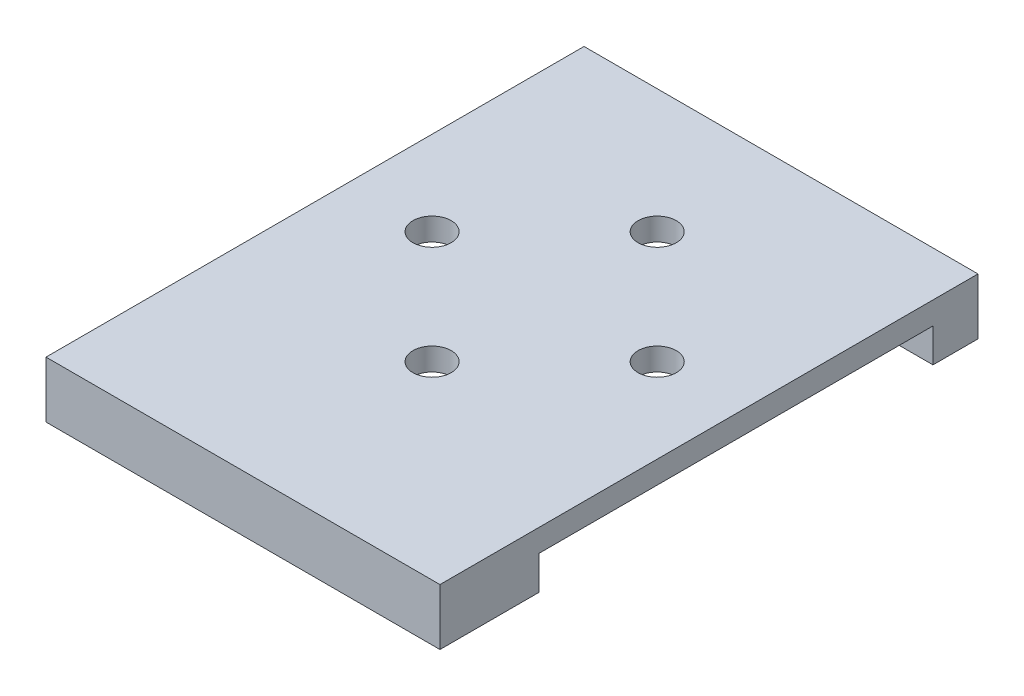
ISO-10303-21;
HEADER;
FILE_DESCRIPTION(('STEP AP214'),'2;1');
FILE_NAME('part.step','',(''),(''),'','','');
FILE_SCHEMA(('AUTOMOTIVE_DESIGN { 1 0 10303 214 1 1 1 1 }'));
ENDSEC;
DATA;
#1=APPLICATION_CONTEXT('core data for automotive mechanical design processes');
#2=APPLICATION_PROTOCOL_DEFINITION('international standard','automotive_design',2000,#1);
#3=PRODUCT_CONTEXT('',#1,'mechanical');
#4=PRODUCT('Part','Part','',(#3));
#5=PRODUCT_RELATED_PRODUCT_CATEGORY('part','',(#4));
#6=PRODUCT_DEFINITION_FORMATION('','',#4);
#7=PRODUCT_DEFINITION_CONTEXT('part definition',#1,'design');
#8=PRODUCT_DEFINITION('design','',#6,#7);
#9=PRODUCT_DEFINITION_SHAPE('','',#8);
#10=(LENGTH_UNIT() NAMED_UNIT(*) SI_UNIT(.MILLI.,.METRE.));
#11=(NAMED_UNIT(*) PLANE_ANGLE_UNIT() SI_UNIT($,.RADIAN.));
#12=(NAMED_UNIT(*) SI_UNIT($,.STERADIAN.) SOLID_ANGLE_UNIT());
#13=UNCERTAINTY_MEASURE_WITH_UNIT(LENGTH_MEASURE(1.E-05),#10,'distance_accuracy_value','');
#14=(GEOMETRIC_REPRESENTATION_CONTEXT(3) GLOBAL_UNCERTAINTY_ASSIGNED_CONTEXT((#13)) GLOBAL_UNIT_ASSIGNED_CONTEXT((#10,
#11,#12)) REPRESENTATION_CONTEXT('',''));
#15=CARTESIAN_POINT('',(0.,0.,0.));
#16=DIRECTION('',(0.,0.,1.));
#17=DIRECTION('',(1.,0.,0.));
#18=AXIS2_PLACEMENT_3D('',#15,#16,#17);
#19=CARTESIAN_POINT('',(0.,0.,0.));
#20=DIRECTION('',(0.,1.,0.));
#21=DIRECTION('',(0.,0.,1.));
#22=AXIS2_PLACEMENT_3D('',#19,#20,#21);
#23=PLANE('',#22);
#24=DIRECTION('',(0.,0.,-1.));
#25=VECTOR('',#24,1.);
#26=CARTESIAN_POINT('',(17.5,0.,23.9));
#27=LINE('',#26,#25);
#28=CARTESIAN_POINT('',(17.5,0.,-19.9));
#29=VERTEX_POINT('',#28);
#30=CARTESIAN_POINT('',(17.5,0.,-23.9));
#31=VERTEX_POINT('',#30);
#32=EDGE_CURVE('E125',#29,#31,#27,.T.);
#33=ORIENTED_EDGE('',*,*,#32,.F.);
#34=DIRECTION('',(-1.,0.,0.));
#35=VECTOR('',#34,1.);
#36=CARTESIAN_POINT('',(17.5,0.,-19.9));
#37=LINE('',#36,#35);
#38=CARTESIAN_POINT('',(-17.5,0.,-19.9));
#39=VERTEX_POINT('',#38);
#40=EDGE_CURVE('E108',#29,#39,#37,.T.);
#41=ORIENTED_EDGE('',*,*,#40,.T.);
#42=DIRECTION('',(0.,0.,1.));
#43=VECTOR('',#42,1.);
#44=CARTESIAN_POINT('',(-17.5,0.,23.9));
#45=LINE('',#44,#43);
#46=CARTESIAN_POINT('',(-17.5,0.,-23.9));
#47=VERTEX_POINT('',#46);
#48=EDGE_CURVE('E133',#47,#39,#45,.T.);
#49=ORIENTED_EDGE('',*,*,#48,.F.);
#50=DIRECTION('',(-1.,0.,0.));
#51=VECTOR('',#50,1.);
#52=CARTESIAN_POINT('',(17.5,0.,-23.9));
#53=LINE('',#52,#51);
#54=EDGE_CURVE('E79',#31,#47,#53,.T.);
#55=ORIENTED_EDGE('',*,*,#54,.F.);
#56=EDGE_LOOP('',(#33,#41,#49,#55));
#57=FACE_BOUND('',#56,.T.);
#58=ADVANCED_FACE('F33',(#57),#23,.F.);
#59=CARTESIAN_POINT('',(-17.5,5.,23.9));
#60=DIRECTION('',(1.,0.,0.));
#61=DIRECTION('',(0.,0.,-1.));
#62=AXIS2_PLACEMENT_3D('',#59,#60,#61);
#63=PLANE('',#62);
#64=ORIENTED_EDGE('',*,*,#48,.T.);
#65=DIRECTION('',(0.,-1.,0.));
#66=VECTOR('',#65,1.);
#67=CARTESIAN_POINT('',(-17.5,0.,-19.9));
#68=LINE('',#67,#66);
#69=CARTESIAN_POINT('',(-17.5,3.,-19.9));
#70=VERTEX_POINT('',#69);
#71=EDGE_CURVE('E114',#70,#39,#68,.T.);
#72=ORIENTED_EDGE('',*,*,#71,.F.);
#73=DIRECTION('',(0.,0.,-1.));
#74=VECTOR('',#73,1.);
#75=CARTESIAN_POINT('',(-17.5,3.,-19.9));
#76=LINE('',#75,#74);
#77=CARTESIAN_POINT('',(-17.5,3.,15.1));
#78=VERTEX_POINT('',#77);
#79=EDGE_CURVE('E127',#78,#70,#76,.T.);
#80=ORIENTED_EDGE('',*,*,#79,.F.);
#81=DIRECTION('',(0.,1.,0.));
#82=VECTOR('',#81,1.);
#83=CARTESIAN_POINT('',(-17.5,0.,15.1));
#84=LINE('',#83,#82);
#85=CARTESIAN_POINT('',(-17.5,0.,15.1));
#86=VERTEX_POINT('',#85);
#87=EDGE_CURVE('E188',#86,#78,#84,.T.);
#88=ORIENTED_EDGE('',*,*,#87,.F.);
#89=CARTESIAN_POINT('',(-17.5,0.,23.9));
#90=VERTEX_POINT('',#89);
#91=EDGE_CURVE('E151',#86,#90,#45,.T.);
#92=ORIENTED_EDGE('',*,*,#91,.T.);
#93=DIRECTION('',(0.,-1.,0.));
#94=VECTOR('',#93,1.);
#95=CARTESIAN_POINT('',(-17.5,5.,23.9));
#96=LINE('',#95,#94);
#97=CARTESIAN_POINT('',(-17.5,5.,23.9));
#98=VERTEX_POINT('',#97);
#99=EDGE_CURVE('E11',#98,#90,#96,.T.);
#100=ORIENTED_EDGE('',*,*,#99,.F.);
#101=DIRECTION('',(0.,0.,1.));
#102=VECTOR('',#101,1.);
#103=CARTESIAN_POINT('',(-17.5,5.,23.9));
#104=LINE('',#103,#102);
#105=CARTESIAN_POINT('',(-17.5,5.,-23.9));
#106=VERTEX_POINT('',#105);
#107=EDGE_CURVE('E138',#106,#98,#104,.T.);
#108=ORIENTED_EDGE('',*,*,#107,.F.);
#109=DIRECTION('',(0.,-1.,0.));
#110=VECTOR('',#109,1.);
#111=CARTESIAN_POINT('',(-17.5,5.,-23.9));
#112=LINE('',#111,#110);
#113=EDGE_CURVE('E139',#106,#47,#112,.T.);
#114=ORIENTED_EDGE('',*,*,#113,.T.);
#115=EDGE_LOOP('',(#64,#72,#80,#88,#92,#100,#108,#114));
#116=FACE_BOUND('',#115,.T.);
#117=ADVANCED_FACE('F35',(#116),#63,.F.);
#118=CARTESIAN_POINT('',(17.5,5.,23.9));
#119=DIRECTION('',(0.,0.,-1.));
#120=DIRECTION('',(-1.,0.,0.));
#121=AXIS2_PLACEMENT_3D('',#118,#119,#120);
#122=PLANE('',#121);
#123=DIRECTION('',(1.,0.,0.));
#124=VECTOR('',#123,1.);
#125=CARTESIAN_POINT('',(17.5,0.,23.9));
#126=LINE('',#125,#124);
#127=CARTESIAN_POINT('',(17.5,0.,23.9));
#128=VERTEX_POINT('',#127);
#129=EDGE_CURVE('E130',#90,#128,#126,.T.);
#130=ORIENTED_EDGE('',*,*,#129,.T.);
#131=DIRECTION('',(0.,-1.,0.));
#132=VECTOR('',#131,1.);
#133=CARTESIAN_POINT('',(17.5,5.,23.9));
#134=LINE('',#133,#132);
#135=CARTESIAN_POINT('',(17.5,5.,23.9));
#136=VERTEX_POINT('',#135);
#137=EDGE_CURVE('E42',#136,#128,#134,.T.);
#138=ORIENTED_EDGE('',*,*,#137,.F.);
#139=DIRECTION('',(1.,0.,0.));
#140=VECTOR('',#139,1.);
#141=CARTESIAN_POINT('',(17.5,5.,23.9));
#142=LINE('',#141,#140);
#143=EDGE_CURVE('E86',#98,#136,#142,.T.);
#144=ORIENTED_EDGE('',*,*,#143,.F.);
#145=ORIENTED_EDGE('',*,*,#99,.T.);
#146=EDGE_LOOP('',(#130,#138,#144,#145));
#147=FACE_BOUND('',#146,.T.);
#148=ADVANCED_FACE('F227',(#147),#122,.F.);
#149=CARTESIAN_POINT('',(17.5,5.,23.9));
#150=DIRECTION('',(-1.,0.,0.));
#151=DIRECTION('',(0.,0.,1.));
#152=AXIS2_PLACEMENT_3D('',#149,#150,#151);
#153=PLANE('',#152);
#154=DIRECTION('',(0.,0.,-1.));
#155=VECTOR('',#154,1.);
#156=CARTESIAN_POINT('',(17.5,3.,-19.9));
#157=LINE('',#156,#155);
#158=CARTESIAN_POINT('',(17.5,3.,15.1));
#159=VERTEX_POINT('',#158);
#160=CARTESIAN_POINT('',(17.5,3.,-19.9));
#161=VERTEX_POINT('',#160);
#162=EDGE_CURVE('E120',#159,#161,#157,.T.);
#163=ORIENTED_EDGE('',*,*,#162,.T.);
#164=DIRECTION('',(0.,-1.,0.));
#165=VECTOR('',#164,1.);
#166=CARTESIAN_POINT('',(17.5,0.,-19.9));
#167=LINE('',#166,#165);
#168=EDGE_CURVE('E111',#161,#29,#167,.T.);
#169=ORIENTED_EDGE('',*,*,#168,.T.);
#170=ORIENTED_EDGE('',*,*,#32,.T.);
#171=DIRECTION('',(0.,-1.,0.));
#172=VECTOR('',#171,1.);
#173=CARTESIAN_POINT('',(17.5,5.,-23.9));
#174=LINE('',#173,#172);
#175=CARTESIAN_POINT('',(17.5,5.,-23.9));
#176=VERTEX_POINT('',#175);
#177=EDGE_CURVE('E141',#176,#31,#174,.T.);
#178=ORIENTED_EDGE('',*,*,#177,.F.);
#179=DIRECTION('',(0.,0.,-1.));
#180=VECTOR('',#179,1.);
#181=CARTESIAN_POINT('',(17.5,5.,23.9));
#182=LINE('',#181,#180);
#183=EDGE_CURVE('E146',#136,#176,#182,.T.);
#184=ORIENTED_EDGE('',*,*,#183,.F.);
#185=ORIENTED_EDGE('',*,*,#137,.T.);
#186=CARTESIAN_POINT('',(17.5,0.,15.1));
#187=VERTEX_POINT('',#186);
#188=EDGE_CURVE('E129',#128,#187,#27,.T.);
#189=ORIENTED_EDGE('',*,*,#188,.T.);
#190=DIRECTION('',(0.,1.,0.));
#191=VECTOR('',#190,1.);
#192=CARTESIAN_POINT('',(17.5,0.,15.1));
#193=LINE('',#192,#191);
#194=EDGE_CURVE('E49',#187,#159,#193,.T.);
#195=ORIENTED_EDGE('',*,*,#194,.T.);
#196=EDGE_LOOP('',(#163,#169,#170,#178,#184,#185,#189,#195));
#197=FACE_BOUND('',#196,.T.);
#198=ADVANCED_FACE('F123',(#197),#153,.F.);
#199=CARTESIAN_POINT('',(17.5,5.,-23.9));
#200=DIRECTION('',(0.,0.,1.));
#201=DIRECTION('',(1.,0.,0.));
#202=AXIS2_PLACEMENT_3D('',#199,#200,#201);
#203=PLANE('',#202);
#204=ORIENTED_EDGE('',*,*,#54,.T.);
#205=ORIENTED_EDGE('',*,*,#113,.F.);
#206=DIRECTION('',(-1.,0.,0.));
#207=VECTOR('',#206,1.);
#208=CARTESIAN_POINT('',(17.5,5.,-23.9));
#209=LINE('',#208,#207);
#210=EDGE_CURVE('E58',#176,#106,#209,.T.);
#211=ORIENTED_EDGE('',*,*,#210,.F.);
#212=ORIENTED_EDGE('',*,*,#177,.T.);
#213=EDGE_LOOP('',(#204,#205,#211,#212));
#214=FACE_BOUND('',#213,.T.);
#215=ADVANCED_FACE('F219',(#214),#203,.F.);
#216=CARTESIAN_POINT('',(0.,5.,0.));
#217=DIRECTION('',(0.,1.,0.));
#218=DIRECTION('',(0.,0.,1.));
#219=AXIS2_PLACEMENT_3D('',#216,#217,#218);
#220=PLANE('',#219);
#221=CARTESIAN_POINT('',(0.,5.,7.10000000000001));
#222=DIRECTION('',(0.,1.,0.));
#223=DIRECTION('',(0.,0.,1.));
#224=AXIS2_PLACEMENT_3D('',#221,#222,#223);
#225=CIRCLE('',#224,1.7);
#226=CARTESIAN_POINT('',(0.,5.,8.80000000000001));
#227=VERTEX_POINT('',#226);
#228=EDGE_CURVE('E170',#227,#227,#225,.T.);
#229=ORIENTED_EDGE('',*,*,#228,.F.);
#230=EDGE_LOOP('',(#229));
#231=FACE_BOUND('',#230,.T.);
#232=CARTESIAN_POINT('',(10.,5.,-2.9));
#233=DIRECTION('',(0.,1.,0.));
#234=DIRECTION('',(0.,0.,1.));
#235=AXIS2_PLACEMENT_3D('',#232,#233,#234);
#236=CIRCLE('',#235,1.7);
#237=CARTESIAN_POINT('',(10.,5.,-1.2));
#238=VERTEX_POINT('',#237);
#239=EDGE_CURVE('E174',#238,#238,#236,.T.);
#240=ORIENTED_EDGE('',*,*,#239,.F.);
#241=EDGE_LOOP('',(#240));
#242=FACE_BOUND('',#241,.T.);
#243=CARTESIAN_POINT('',(-10.,5.,-2.89999999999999));
#244=DIRECTION('',(0.,1.,0.));
#245=DIRECTION('',(0.,0.,1.));
#246=AXIS2_PLACEMENT_3D('',#243,#244,#245);
#247=CIRCLE('',#246,1.7);
#248=CARTESIAN_POINT('',(-10.,5.,-1.2));
#249=VERTEX_POINT('',#248);
#250=EDGE_CURVE('E169',#249,#249,#247,.T.);
#251=ORIENTED_EDGE('',*,*,#250,.F.);
#252=EDGE_LOOP('',(#251));
#253=FACE_BOUND('',#252,.T.);
#254=CARTESIAN_POINT('',(0.,5.,-12.9));
#255=DIRECTION('',(0.,1.,0.));
#256=DIRECTION('',(0.,0.,1.));
#257=AXIS2_PLACEMENT_3D('',#254,#255,#256);
#258=CIRCLE('',#257,1.7);
#259=CARTESIAN_POINT('',(0.,5.,-11.2));
#260=VERTEX_POINT('',#259);
#261=EDGE_CURVE('E173',#260,#260,#258,.T.);
#262=ORIENTED_EDGE('',*,*,#261,.F.);
#263=EDGE_LOOP('',(#262));
#264=FACE_BOUND('',#263,.T.);
#265=ORIENTED_EDGE('',*,*,#107,.T.);
#266=ORIENTED_EDGE('',*,*,#143,.T.);
#267=ORIENTED_EDGE('',*,*,#183,.T.);
#268=ORIENTED_EDGE('',*,*,#210,.T.);
#269=EDGE_LOOP('',(#265,#266,#267,#268));
#270=FACE_BOUND('',#269,.T.);
#271=ADVANCED_FACE('F217',(#231,#242,#253,#264,#270),#220,.T.);
#272=ORIENTED_EDGE('',*,*,#91,.F.);
#273=DIRECTION('',(-1.,0.,0.));
#274=VECTOR('',#273,1.);
#275=CARTESIAN_POINT('',(17.5,0.,15.1));
#276=LINE('',#275,#274);
#277=EDGE_CURVE('E119',#187,#86,#276,.T.);
#278=ORIENTED_EDGE('',*,*,#277,.F.);
#279=ORIENTED_EDGE('',*,*,#188,.F.);
#280=ORIENTED_EDGE('',*,*,#129,.F.);
#281=EDGE_LOOP('',(#272,#278,#279,#280));
#282=FACE_BOUND('',#281,.T.);
#283=ADVANCED_FACE('F150',(#282),#23,.F.);
#284=CARTESIAN_POINT('',(0.,0.,-12.9));
#285=DIRECTION('',(0.,1.,0.));
#286=DIRECTION('',(0.,0.,1.));
#287=AXIS2_PLACEMENT_3D('',#284,#285,#286);
#288=CYLINDRICAL_SURFACE('',#287,1.7);
#289=CARTESIAN_POINT('',(0.,3.,-12.9));
#290=DIRECTION('',(0.,1.,0.));
#291=DIRECTION('',(0.,0.,1.));
#292=AXIS2_PLACEMENT_3D('',#289,#290,#291);
#293=CIRCLE('',#292,1.7);
#294=CARTESIAN_POINT('',(0.,3.,-11.2));
#295=VERTEX_POINT('',#294);
#296=EDGE_CURVE('E166',#295,#295,#293,.F.);
#297=ORIENTED_EDGE('',*,*,#296,.T.);
#298=EDGE_LOOP('',(#297));
#299=FACE_BOUND('',#298,.T.);
#300=ORIENTED_EDGE('',*,*,#261,.T.);
#301=EDGE_LOOP('',(#300));
#302=FACE_BOUND('',#301,.T.);
#303=ADVANCED_FACE('F210',(#299,#302),#288,.F.);
#304=CARTESIAN_POINT('',(-10.,0.,-2.89999999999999));
#305=DIRECTION('',(0.,1.,0.));
#306=DIRECTION('',(0.,0.,1.));
#307=AXIS2_PLACEMENT_3D('',#304,#305,#306);
#308=CYLINDRICAL_SURFACE('',#307,1.7);
#309=CARTESIAN_POINT('',(-10.,3.,-2.89999999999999));
#310=DIRECTION('',(0.,1.,0.));
#311=DIRECTION('',(0.,0.,1.));
#312=AXIS2_PLACEMENT_3D('',#309,#310,#311);
#313=CIRCLE('',#312,1.7);
#314=CARTESIAN_POINT('',(-10.,3.,-1.2));
#315=VERTEX_POINT('',#314);
#316=EDGE_CURVE('E163',#315,#315,#313,.F.);
#317=ORIENTED_EDGE('',*,*,#316,.T.);
#318=EDGE_LOOP('',(#317));
#319=FACE_BOUND('',#318,.T.);
#320=ORIENTED_EDGE('',*,*,#250,.T.);
#321=EDGE_LOOP('',(#320));
#322=FACE_BOUND('',#321,.T.);
#323=ADVANCED_FACE('F213',(#319,#322),#308,.F.);
#324=CARTESIAN_POINT('',(10.,0.,-2.9));
#325=DIRECTION('',(0.,1.,0.));
#326=DIRECTION('',(0.,0.,1.));
#327=AXIS2_PLACEMENT_3D('',#324,#325,#326);
#328=CYLINDRICAL_SURFACE('',#327,1.7);
#329=CARTESIAN_POINT('',(10.,3.,-2.9));
#330=DIRECTION('',(0.,1.,0.));
#331=DIRECTION('',(0.,0.,1.));
#332=AXIS2_PLACEMENT_3D('',#329,#330,#331);
#333=CIRCLE('',#332,1.7);
#334=CARTESIAN_POINT('',(10.,3.,-1.2));
#335=VERTEX_POINT('',#334);
#336=EDGE_CURVE('E160',#335,#335,#333,.F.);
#337=ORIENTED_EDGE('',*,*,#336,.T.);
#338=EDGE_LOOP('',(#337));
#339=FACE_BOUND('',#338,.T.);
#340=ORIENTED_EDGE('',*,*,#239,.T.);
#341=EDGE_LOOP('',(#340));
#342=FACE_BOUND('',#341,.T.);
#343=ADVANCED_FACE('F250',(#339,#342),#328,.F.);
#344=CARTESIAN_POINT('',(0.,0.,7.10000000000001));
#345=DIRECTION('',(0.,1.,0.));
#346=DIRECTION('',(0.,0.,1.));
#347=AXIS2_PLACEMENT_3D('',#344,#345,#346);
#348=CYLINDRICAL_SURFACE('',#347,1.7);
#349=CARTESIAN_POINT('',(0.,3.,7.10000000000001));
#350=DIRECTION('',(0.,1.,0.));
#351=DIRECTION('',(0.,0.,1.));
#352=AXIS2_PLACEMENT_3D('',#349,#350,#351);
#353=CIRCLE('',#352,1.7);
#354=CARTESIAN_POINT('',(0.,3.,8.80000000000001));
#355=VERTEX_POINT('',#354);
#356=EDGE_CURVE('E37',#355,#355,#353,.F.);
#357=ORIENTED_EDGE('',*,*,#356,.T.);
#358=EDGE_LOOP('',(#357));
#359=FACE_BOUND('',#358,.T.);
#360=ORIENTED_EDGE('',*,*,#228,.T.);
#361=EDGE_LOOP('',(#360));
#362=FACE_BOUND('',#361,.T.);
#363=ADVANCED_FACE('F197',(#359,#362),#348,.F.);
#364=CARTESIAN_POINT('',(17.5,3.,-19.9));
#365=DIRECTION('',(0.,1.,0.));
#366=DIRECTION('',(0.,0.,1.));
#367=AXIS2_PLACEMENT_3D('',#364,#365,#366);
#368=PLANE('',#367);
#369=ORIENTED_EDGE('',*,*,#316,.F.);
#370=EDGE_LOOP('',(#369));
#371=FACE_BOUND('',#370,.T.);
#372=ORIENTED_EDGE('',*,*,#356,.F.);
#373=EDGE_LOOP('',(#372));
#374=FACE_BOUND('',#373,.T.);
#375=ORIENTED_EDGE('',*,*,#79,.T.);
#376=DIRECTION('',(-1.,0.,0.));
#377=VECTOR('',#376,1.);
#378=CARTESIAN_POINT('',(17.5,3.,-19.9));
#379=LINE('',#378,#377);
#380=EDGE_CURVE('E156',#161,#70,#379,.T.);
#381=ORIENTED_EDGE('',*,*,#380,.F.);
#382=ORIENTED_EDGE('',*,*,#162,.F.);
#383=DIRECTION('',(-1.,0.,0.));
#384=VECTOR('',#383,1.);
#385=CARTESIAN_POINT('',(17.5,3.,15.1));
#386=LINE('',#385,#384);
#387=EDGE_CURVE('E154',#159,#78,#386,.T.);
#388=ORIENTED_EDGE('',*,*,#387,.T.);
#389=EDGE_LOOP('',(#375,#381,#382,#388));
#390=FACE_BOUND('',#389,.T.);
#391=ORIENTED_EDGE('',*,*,#336,.F.);
#392=EDGE_LOOP('',(#391));
#393=FACE_BOUND('',#392,.T.);
#394=ORIENTED_EDGE('',*,*,#296,.F.);
#395=EDGE_LOOP('',(#394));
#396=FACE_BOUND('',#395,.T.);
#397=ADVANCED_FACE('F200',(#371,#374,#390,#393,#396),#368,.F.);
#398=CARTESIAN_POINT('',(17.5,0.,-19.9));
#399=DIRECTION('',(0.,0.,-1.));
#400=DIRECTION('',(0.,1.,0.));
#401=AXIS2_PLACEMENT_3D('',#398,#399,#400);
#402=PLANE('',#401);
#403=ORIENTED_EDGE('',*,*,#71,.T.);
#404=ORIENTED_EDGE('',*,*,#40,.F.);
#405=ORIENTED_EDGE('',*,*,#168,.F.);
#406=ORIENTED_EDGE('',*,*,#380,.T.);
#407=EDGE_LOOP('',(#403,#404,#405,#406));
#408=FACE_BOUND('',#407,.T.);
#409=ADVANCED_FACE('F110',(#408),#402,.F.);
#410=CARTESIAN_POINT('',(17.5,0.,15.1));
#411=DIRECTION('',(0.,0.,1.));
#412=DIRECTION('',(0.,-1.,0.));
#413=AXIS2_PLACEMENT_3D('',#410,#411,#412);
#414=PLANE('',#413);
#415=ORIENTED_EDGE('',*,*,#87,.T.);
#416=ORIENTED_EDGE('',*,*,#387,.F.);
#417=ORIENTED_EDGE('',*,*,#194,.F.);
#418=ORIENTED_EDGE('',*,*,#277,.T.);
#419=EDGE_LOOP('',(#415,#416,#417,#418));
#420=FACE_BOUND('',#419,.T.);
#421=ADVANCED_FACE('F275',(#420),#414,.F.);
#422=CLOSED_SHELL('',(#58,#117,#148,#198,#215,#271,#283,#303,#323,#343,#363,#397,#409,#421));
#423=MANIFOLD_SOLID_BREP('B2',#422);
#424=ADVANCED_BREP_SHAPE_REPRESENTATION('',(#18,#423),#14);
#425=SHAPE_DEFINITION_REPRESENTATION(#9,#424);
ENDSEC;
END-ISO-10303-21;
